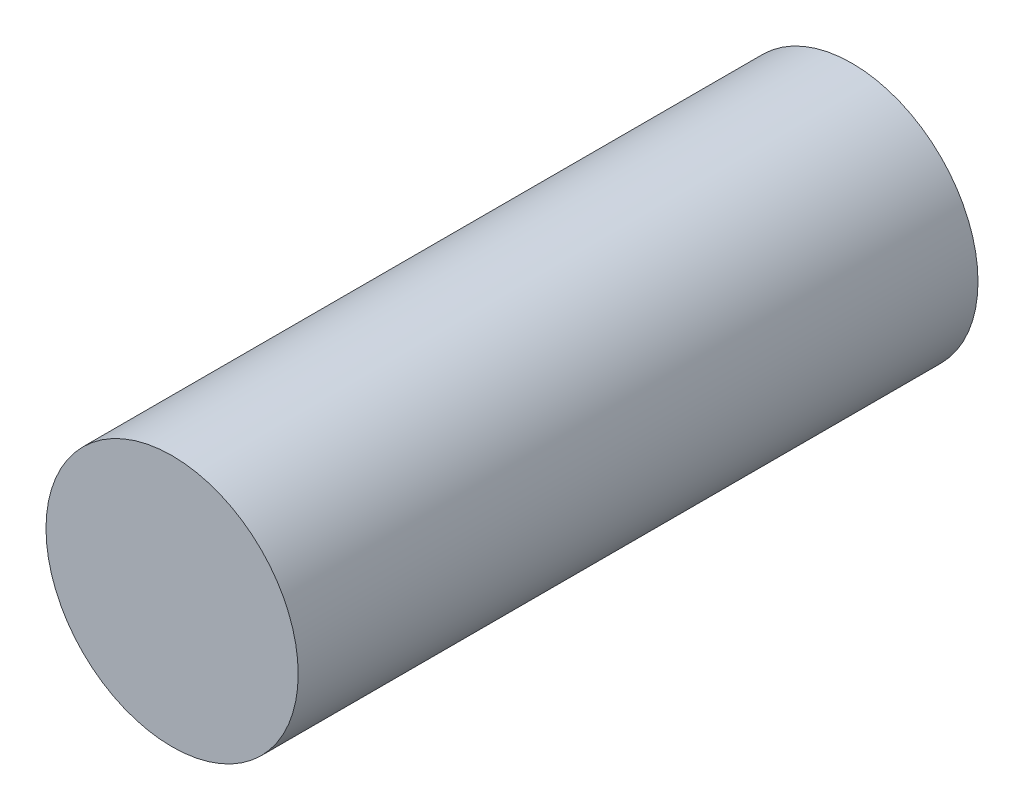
ISO-10303-21;
HEADER;
FILE_DESCRIPTION(('STEP AP214'),'2;1');
FILE_NAME('part.step','',(''),(''),'','','');
FILE_SCHEMA(('AUTOMOTIVE_DESIGN { 1 0 10303 214 1 1 1 1 }'));
ENDSEC;
DATA;
#1=APPLICATION_CONTEXT('core data for automotive mechanical design processes');
#2=APPLICATION_PROTOCOL_DEFINITION('international standard','automotive_design',2000,#1);
#3=PRODUCT_CONTEXT('',#1,'mechanical');
#4=PRODUCT('Part','Part','',(#3));
#5=PRODUCT_RELATED_PRODUCT_CATEGORY('part','',(#4));
#6=PRODUCT_DEFINITION_FORMATION('','',#4);
#7=PRODUCT_DEFINITION_CONTEXT('part definition',#1,'design');
#8=PRODUCT_DEFINITION('design','',#6,#7);
#9=PRODUCT_DEFINITION_SHAPE('','',#8);
#10=(LENGTH_UNIT() NAMED_UNIT(*) SI_UNIT(.MILLI.,.METRE.));
#11=(NAMED_UNIT(*) PLANE_ANGLE_UNIT() SI_UNIT($,.RADIAN.));
#12=(NAMED_UNIT(*) SI_UNIT($,.STERADIAN.) SOLID_ANGLE_UNIT());
#13=UNCERTAINTY_MEASURE_WITH_UNIT(LENGTH_MEASURE(1.E-05),#10,'distance_accuracy_value','');
#14=(GEOMETRIC_REPRESENTATION_CONTEXT(3) GLOBAL_UNCERTAINTY_ASSIGNED_CONTEXT((#13)) GLOBAL_UNIT_ASSIGNED_CONTEXT((#10,
#11,#12)) REPRESENTATION_CONTEXT('',''));
#15=CARTESIAN_POINT('',(0.,0.,0.));
#16=DIRECTION('',(0.,0.,1.));
#17=DIRECTION('',(1.,0.,0.));
#18=AXIS2_PLACEMENT_3D('',#15,#16,#17);
#19=CARTESIAN_POINT('',(0.,0.,310.));
#20=DIRECTION('',(0.,0.,-1.));
#21=DIRECTION('',(-1.,0.,0.));
#22=AXIS2_PLACEMENT_3D('',#19,#20,#21);
#23=CYLINDRICAL_SURFACE('',#22,57.5000000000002);
#24=CARTESIAN_POINT('',(0.,0.,310.));
#25=DIRECTION('',(0.,0.,1.));
#26=DIRECTION('',(1.,0.,0.));
#27=AXIS2_PLACEMENT_3D('',#24,#25,#26);
#28=CIRCLE('',#27,57.5000000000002);
#29=CARTESIAN_POINT('',(57.5000000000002,0.,310.));
#30=VERTEX_POINT('',#29);
#31=EDGE_CURVE('E10',#30,#30,#28,.T.);
#32=ORIENTED_EDGE('',*,*,#31,.F.);
#33=EDGE_LOOP('',(#32));
#34=FACE_BOUND('',#33,.T.);
#35=CARTESIAN_POINT('',(0.,0.,0.));
#36=DIRECTION('',(0.,0.,1.));
#37=DIRECTION('',(1.,0.,0.));
#38=AXIS2_PLACEMENT_3D('',#35,#36,#37);
#39=CIRCLE('',#38,57.5000000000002);
#40=CARTESIAN_POINT('',(57.5000000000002,0.,0.));
#41=VERTEX_POINT('',#40);
#42=EDGE_CURVE('E30',#41,#41,#39,.T.);
#43=ORIENTED_EDGE('',*,*,#42,.T.);
#44=EDGE_LOOP('',(#43));
#45=FACE_BOUND('',#44,.T.);
#46=ADVANCED_FACE('F24',(#34,#45),#23,.T.);
#47=CARTESIAN_POINT('',(0.,0.,310.));
#48=DIRECTION('',(0.,0.,1.));
#49=DIRECTION('',(1.,0.,0.));
#50=AXIS2_PLACEMENT_3D('',#47,#48,#49);
#51=PLANE('',#50);
#52=ORIENTED_EDGE('',*,*,#31,.T.);
#53=EDGE_LOOP('',(#52));
#54=FACE_BOUND('',#53,.T.);
#55=ADVANCED_FACE('F39',(#54),#51,.T.);
#56=CARTESIAN_POINT('',(0.,0.,0.));
#57=DIRECTION('',(0.,0.,1.));
#58=DIRECTION('',(1.,0.,0.));
#59=AXIS2_PLACEMENT_3D('',#56,#57,#58);
#60=PLANE('',#59);
#61=ORIENTED_EDGE('',*,*,#42,.F.);
#62=EDGE_LOOP('',(#61));
#63=FACE_BOUND('',#62,.T.);
#64=ADVANCED_FACE('F37',(#63),#60,.F.);
#65=CLOSED_SHELL('',(#46,#55,#64));
#66=MANIFOLD_SOLID_BREP('B2',#65);
#67=ADVANCED_BREP_SHAPE_REPRESENTATION('',(#18,#66),#14);
#68=SHAPE_DEFINITION_REPRESENTATION(#9,#67);
ENDSEC;
END-ISO-10303-21;
